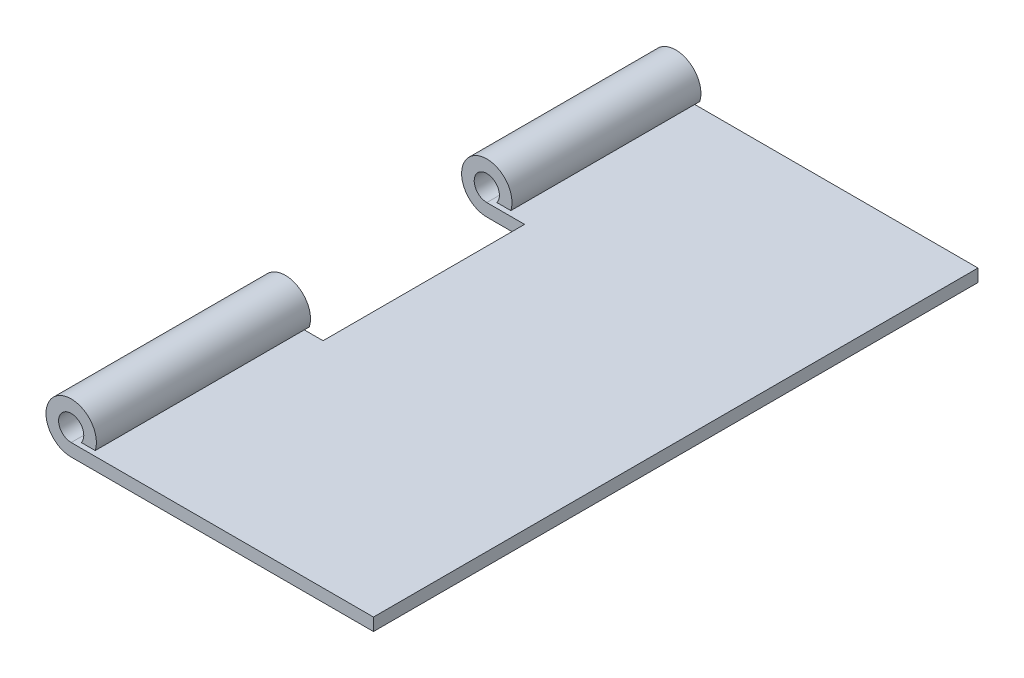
ISO-10303-21;
HEADER;
FILE_DESCRIPTION(('STEP AP214'),'2;1');
FILE_NAME('part.step','',(''),(''),'','','');
FILE_SCHEMA(('AUTOMOTIVE_DESIGN { 1 0 10303 214 1 1 1 1 }'));
ENDSEC;
DATA;
#1=APPLICATION_CONTEXT('core data for automotive mechanical design processes');
#2=APPLICATION_PROTOCOL_DEFINITION('international standard','automotive_design',2000,#1);
#3=PRODUCT_CONTEXT('',#1,'mechanical');
#4=PRODUCT('Part','Part','',(#3));
#5=PRODUCT_RELATED_PRODUCT_CATEGORY('part','',(#4));
#6=PRODUCT_DEFINITION_FORMATION('','',#4);
#7=PRODUCT_DEFINITION_CONTEXT('part definition',#1,'design');
#8=PRODUCT_DEFINITION('design','',#6,#7);
#9=PRODUCT_DEFINITION_SHAPE('','',#8);
#10=(LENGTH_UNIT() NAMED_UNIT(*) SI_UNIT(.MILLI.,.METRE.));
#11=(NAMED_UNIT(*) PLANE_ANGLE_UNIT() SI_UNIT($,.RADIAN.));
#12=(NAMED_UNIT(*) SI_UNIT($,.STERADIAN.) SOLID_ANGLE_UNIT());
#13=UNCERTAINTY_MEASURE_WITH_UNIT(LENGTH_MEASURE(1.E-05),#10,'distance_accuracy_value','');
#14=(GEOMETRIC_REPRESENTATION_CONTEXT(3) GLOBAL_UNCERTAINTY_ASSIGNED_CONTEXT((#13)) GLOBAL_UNIT_ASSIGNED_CONTEXT((#10,
#11,#12)) REPRESENTATION_CONTEXT('',''));
#15=CARTESIAN_POINT('',(0.,0.,0.));
#16=DIRECTION('',(0.,0.,1.));
#17=DIRECTION('',(1.,0.,0.));
#18=AXIS2_PLACEMENT_3D('',#15,#16,#17);
#19=CARTESIAN_POINT('',(39.59012726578,8.80634716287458,60.));
#20=DIRECTION('',(0.,0.,-1.));
#21=DIRECTION('',(-1.,0.,0.));
#22=AXIS2_PLACEMENT_3D('',#19,#20,#21);
#23=CYLINDRICAL_SURFACE('',#22,2.5);
#24=DIRECTION('',(0.,0.,-1.));
#25=VECTOR('',#24,1.);
#26=CARTESIAN_POINT('',(39.59012726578,6.30634716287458,60.));
#27=LINE('',#26,#25);
#28=CARTESIAN_POINT('',(39.59012726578,6.30634716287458,60.));
#29=VERTEX_POINT('',#28);
#30=CARTESIAN_POINT('',(39.59012726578,6.30634716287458,39.8734177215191));
#31=VERTEX_POINT('',#30);
#32=EDGE_CURVE('E213',#29,#31,#27,.T.);
#33=ORIENTED_EDGE('',*,*,#32,.T.);
#34=CARTESIAN_POINT('',(39.59012726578,8.80634716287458,39.8734177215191));
#35=DIRECTION('',(0.,0.,-1.));
#36=DIRECTION('',(-1.,0.,0.));
#37=AXIS2_PLACEMENT_3D('',#34,#35,#36);
#38=CIRCLE('',#37,2.5);
#39=CARTESIAN_POINT('',(41.59012726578,7.30634716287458,39.8734177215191));
#40=VERTEX_POINT('',#39);
#41=EDGE_CURVE('E11',#31,#40,#38,.T.);
#42=ORIENTED_EDGE('',*,*,#41,.T.);
#43=DIRECTION('',(0.,0.,-1.));
#44=VECTOR('',#43,1.);
#45=CARTESIAN_POINT('',(41.59012726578,7.30634716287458,60.));
#46=LINE('',#45,#44);
#47=CARTESIAN_POINT('',(41.59012726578,7.30634716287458,60.));
#48=VERTEX_POINT('',#47);
#49=EDGE_CURVE('E207',#48,#40,#46,.T.);
#50=ORIENTED_EDGE('',*,*,#49,.F.);
#51=CARTESIAN_POINT('',(39.59012726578,8.80634716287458,60.));
#52=DIRECTION('',(0.,0.,1.));
#53=DIRECTION('',(1.,0.,0.));
#54=AXIS2_PLACEMENT_3D('',#51,#52,#53);
#55=CIRCLE('',#54,2.5);
#56=EDGE_CURVE('E197',#48,#29,#55,.T.);
#57=ORIENTED_EDGE('',*,*,#56,.T.);
#58=EDGE_LOOP('',(#33,#42,#50,#57));
#59=FACE_BOUND('',#58,.T.);
#60=ADVANCED_FACE('F38',(#59),#23,.F.);
#61=CARTESIAN_POINT('',(39.59012726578,6.30634716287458,-22.5));
#62=VERTEX_POINT('',#61);
#63=CARTESIAN_POINT('',(39.59012726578,6.30634716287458,-40.0843881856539));
#64=VERTEX_POINT('',#63);
#65=EDGE_CURVE('E217',#62,#64,#27,.T.);
#66=ORIENTED_EDGE('',*,*,#65,.T.);
#67=CARTESIAN_POINT('',(39.59012726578,8.80634716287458,-40.0843881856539));
#68=DIRECTION('',(0.,0.,-1.));
#69=DIRECTION('',(-1.,0.,0.));
#70=AXIS2_PLACEMENT_3D('',#67,#68,#69);
#71=CIRCLE('',#70,2.5);
#72=CARTESIAN_POINT('',(41.59012726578,7.30634716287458,-40.0843881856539));
#73=VERTEX_POINT('',#72);
#74=EDGE_CURVE('E47',#64,#73,#71,.T.);
#75=ORIENTED_EDGE('',*,*,#74,.T.);
#76=CARTESIAN_POINT('',(41.59012726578,7.30634716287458,-22.5));
#77=VERTEX_POINT('',#76);
#78=EDGE_CURVE('E212',#77,#73,#46,.T.);
#79=ORIENTED_EDGE('',*,*,#78,.F.);
#80=CARTESIAN_POINT('',(39.59012726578,8.80634716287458,-22.5));
#81=DIRECTION('',(0.,0.,-1.));
#82=DIRECTION('',(-1.,0.,0.));
#83=AXIS2_PLACEMENT_3D('',#80,#81,#82);
#84=CIRCLE('',#83,2.5);
#85=EDGE_CURVE('E260',#62,#77,#84,.T.);
#86=ORIENTED_EDGE('',*,*,#85,.F.);
#87=EDGE_LOOP('',(#66,#75,#79,#86));
#88=FACE_BOUND('',#87,.T.);
#89=ADVANCED_FACE('F233',(#88),#23,.F.);
#90=CARTESIAN_POINT('',(39.59012726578,8.80634716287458,60.));
#91=DIRECTION('',(0.,0.,-1.));
#92=DIRECTION('',(-1.,0.,0.));
#93=AXIS2_PLACEMENT_3D('',#90,#91,#92);
#94=CYLINDRICAL_SURFACE('',#93,5.);
#95=DIRECTION('',(0.,0.,-1.));
#96=VECTOR('',#95,1.);
#97=CARTESIAN_POINT('',(44.3598232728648,7.30634716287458,60.));
#98=LINE('',#97,#96);
#99=CARTESIAN_POINT('',(44.3598232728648,7.30634716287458,60.));
#100=VERTEX_POINT('',#99);
#101=CARTESIAN_POINT('',(44.3598232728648,7.30634716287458,17.4999999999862));
#102=VERTEX_POINT('',#101);
#103=EDGE_CURVE('E204',#100,#102,#98,.T.);
#104=ORIENTED_EDGE('',*,*,#103,.T.);
#105=CARTESIAN_POINT('',(39.59012726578,8.80634716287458,17.4999999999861));
#106=DIRECTION('',(0.,0.,-1.));
#107=DIRECTION('',(0.,1.,0.));
#108=AXIS2_PLACEMENT_3D('',#105,#106,#107);
#109=CIRCLE('',#108,5.00000000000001);
#110=CARTESIAN_POINT('',(39.59012726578,3.80634716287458,17.4999999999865));
#111=VERTEX_POINT('',#110);
#112=EDGE_CURVE('E146',#111,#102,#109,.T.);
#113=ORIENTED_EDGE('',*,*,#112,.F.);
#114=DIRECTION('',(0.,0.,-1.));
#115=VECTOR('',#114,1.);
#116=CARTESIAN_POINT('',(39.59012726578,3.80634716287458,60.));
#117=LINE('',#116,#115);
#118=CARTESIAN_POINT('',(39.59012726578,3.80634716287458,60.));
#119=VERTEX_POINT('',#118);
#120=EDGE_CURVE('E142',#119,#111,#117,.T.);
#121=ORIENTED_EDGE('',*,*,#120,.F.);
#122=CARTESIAN_POINT('',(39.59012726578,8.80634716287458,60.));
#123=DIRECTION('',(0.,0.,1.));
#124=DIRECTION('',(1.,0.,0.));
#125=AXIS2_PLACEMENT_3D('',#122,#123,#124);
#126=CIRCLE('',#125,5.);
#127=EDGE_CURVE('E185',#100,#119,#126,.T.);
#128=ORIENTED_EDGE('',*,*,#127,.F.);
#129=EDGE_LOOP('',(#104,#113,#121,#128));
#130=FACE_BOUND('',#129,.T.);
#131=ADVANCED_FACE('F288',(#130),#94,.T.);
#132=ORIENTED_EDGE('',*,*,#41,.F.);
#133=CARTESIAN_POINT('',(39.59012726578,6.30634716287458,17.4999999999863));
#134=VERTEX_POINT('',#133);
#135=EDGE_CURVE('E216',#31,#134,#27,.T.);
#136=ORIENTED_EDGE('',*,*,#135,.T.);
#137=CARTESIAN_POINT('',(39.59012726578,8.80634716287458,17.4999999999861));
#138=DIRECTION('',(0.,0.,-1.));
#139=DIRECTION('',(0.,1.,0.));
#140=AXIS2_PLACEMENT_3D('',#137,#138,#139);
#141=CIRCLE('',#140,2.5);
#142=CARTESIAN_POINT('',(41.59012726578,7.30634716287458,17.4999999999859));
#143=VERTEX_POINT('',#142);
#144=EDGE_CURVE('E252',#143,#134,#141,.F.);
#145=ORIENTED_EDGE('',*,*,#144,.F.);
#146=EDGE_CURVE('E211',#40,#143,#46,.T.);
#147=ORIENTED_EDGE('',*,*,#146,.F.);
#148=EDGE_LOOP('',(#132,#136,#145,#147));
#149=FACE_BOUND('',#148,.T.);
#150=ADVANCED_FACE('F253',(#149),#23,.F.);
#151=CARTESIAN_POINT('',(44.3598232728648,7.30634716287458,60.));
#152=DIRECTION('',(0.,-1.,0.));
#153=DIRECTION('',(1.,0.,0.));
#154=AXIS2_PLACEMENT_3D('',#151,#152,#153);
#155=PLANE('',#154);
#156=ORIENTED_EDGE('',*,*,#146,.T.);
#157=DIRECTION('',(-1.,0.,0.));
#158=VECTOR('',#157,1.);
#159=CARTESIAN_POINT('',(44.3598232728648,7.30634716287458,17.4999999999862));
#160=LINE('',#159,#158);
#161=EDGE_CURVE('E251',#102,#143,#160,.T.);
#162=ORIENTED_EDGE('',*,*,#161,.F.);
#163=ORIENTED_EDGE('',*,*,#103,.F.);
#164=DIRECTION('',(-1.,0.,0.));
#165=VECTOR('',#164,1.);
#166=CARTESIAN_POINT('',(44.3598232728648,7.30634716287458,60.));
#167=LINE('',#166,#165);
#168=EDGE_CURVE('E200',#100,#48,#167,.T.);
#169=ORIENTED_EDGE('',*,*,#168,.T.);
#170=ORIENTED_EDGE('',*,*,#49,.T.);
#171=EDGE_LOOP('',(#156,#162,#163,#169,#170));
#172=FACE_BOUND('',#171,.T.);
#173=ADVANCED_FACE('F249',(#172),#155,.T.);
#174=CARTESIAN_POINT('',(39.59012726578,3.80634716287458,-22.5));
#175=VERTEX_POINT('',#174);
#176=CARTESIAN_POINT('',(39.59012726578,3.80634716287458,-60.));
#177=VERTEX_POINT('',#176);
#178=EDGE_CURVE('E221',#175,#177,#117,.T.);
#179=ORIENTED_EDGE('',*,*,#178,.F.);
#180=CARTESIAN_POINT('',(39.59012726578,8.80634716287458,-22.5));
#181=DIRECTION('',(0.,0.,-1.));
#182=DIRECTION('',(-1.,0.,0.));
#183=AXIS2_PLACEMENT_3D('',#180,#181,#182);
#184=CIRCLE('',#183,5.);
#185=CARTESIAN_POINT('',(44.3598232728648,7.30634716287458,-22.5));
#186=VERTEX_POINT('',#185);
#187=EDGE_CURVE('E167',#175,#186,#184,.T.);
#188=ORIENTED_EDGE('',*,*,#187,.T.);
#189=CARTESIAN_POINT('',(44.3598232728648,7.30634716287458,-60.));
#190=VERTEX_POINT('',#189);
#191=EDGE_CURVE('E203',#186,#190,#98,.T.);
#192=ORIENTED_EDGE('',*,*,#191,.T.);
#193=CARTESIAN_POINT('',(39.59012726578,8.80634716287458,-60.));
#194=DIRECTION('',(0.,0.,1.));
#195=DIRECTION('',(1.,0.,0.));
#196=AXIS2_PLACEMENT_3D('',#193,#194,#195);
#197=CIRCLE('',#196,5.);
#198=EDGE_CURVE('E161',#190,#177,#197,.T.);
#199=ORIENTED_EDGE('',*,*,#198,.T.);
#200=EDGE_LOOP('',(#179,#188,#192,#199));
#201=FACE_BOUND('',#200,.T.);
#202=ADVANCED_FACE('F266',(#201),#94,.T.);
#203=CARTESIAN_POINT('',(39.59012726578,3.80634716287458,60.));
#204=DIRECTION('',(0.,1.,0.));
#205=DIRECTION('',(0.,0.,1.));
#206=AXIS2_PLACEMENT_3D('',#203,#204,#205);
#207=PLANE('',#206);
#208=ORIENTED_EDGE('',*,*,#120,.T.);
#209=DIRECTION('',(-1.,0.,0.));
#210=VECTOR('',#209,1.);
#211=CARTESIAN_POINT('',(39.59012726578,3.80634716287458,17.4999999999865));
#212=LINE('',#211,#210);
#213=CARTESIAN_POINT('',(47.09012726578,3.80634716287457,17.4999999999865));
#214=VERTEX_POINT('',#213);
#215=EDGE_CURVE('E136',#214,#111,#212,.T.);
#216=ORIENTED_EDGE('',*,*,#215,.F.);
#217=DIRECTION('',(0.,0.,1.));
#218=VECTOR('',#217,1.);
#219=CARTESIAN_POINT('',(47.09012726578,3.80634716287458,60.));
#220=LINE('',#219,#218);
#221=CARTESIAN_POINT('',(47.09012726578,3.80634716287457,-22.5));
#222=VERTEX_POINT('',#221);
#223=EDGE_CURVE('E140',#222,#214,#220,.T.);
#224=ORIENTED_EDGE('',*,*,#223,.F.);
#225=DIRECTION('',(-1.,0.,0.));
#226=VECTOR('',#225,1.);
#227=CARTESIAN_POINT('',(39.59012726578,3.80634716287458,-22.5));
#228=LINE('',#227,#226);
#229=EDGE_CURVE('E162',#222,#175,#228,.T.);
#230=ORIENTED_EDGE('',*,*,#229,.T.);
#231=ORIENTED_EDGE('',*,*,#178,.T.);
#232=DIRECTION('',(1.,0.,0.));
#233=VECTOR('',#232,1.);
#234=CARTESIAN_POINT('',(39.59012726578,3.80634716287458,-60.));
#235=LINE('',#234,#233);
#236=CARTESIAN_POINT('',(99.59012726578,3.80634716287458,-60.));
#237=VERTEX_POINT('',#236);
#238=EDGE_CURVE('E165',#177,#237,#235,.T.);
#239=ORIENTED_EDGE('',*,*,#238,.T.);
#240=DIRECTION('',(0.,0.,-1.));
#241=VECTOR('',#240,1.);
#242=CARTESIAN_POINT('',(99.59012726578,3.80634716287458,60.));
#243=LINE('',#242,#241);
#244=CARTESIAN_POINT('',(99.59012726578,3.80634716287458,60.));
#245=VERTEX_POINT('',#244);
#246=EDGE_CURVE('E219',#245,#237,#243,.T.);
#247=ORIENTED_EDGE('',*,*,#246,.F.);
#248=DIRECTION('',(1.,0.,0.));
#249=VECTOR('',#248,1.);
#250=CARTESIAN_POINT('',(39.59012726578,3.80634716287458,60.));
#251=LINE('',#250,#249);
#252=EDGE_CURVE('E188',#119,#245,#251,.T.);
#253=ORIENTED_EDGE('',*,*,#252,.F.);
#254=EDGE_LOOP('',(#208,#216,#224,#230,#231,#239,#247,#253));
#255=FACE_BOUND('',#254,.T.);
#256=ADVANCED_FACE('F40',(#255),#207,.F.);
#257=CARTESIAN_POINT('',(99.59012726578,3.80634716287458,60.));
#258=DIRECTION('',(-1.,0.,0.));
#259=DIRECTION('',(0.,0.,1.));
#260=AXIS2_PLACEMENT_3D('',#257,#258,#259);
#261=PLANE('',#260);
#262=DIRECTION('',(0.,0.,-1.));
#263=VECTOR('',#262,1.);
#264=CARTESIAN_POINT('',(99.59012726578,6.30634716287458,60.));
#265=LINE('',#264,#263);
#266=CARTESIAN_POINT('',(99.59012726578,6.30634716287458,60.));
#267=VERTEX_POINT('',#266);
#268=CARTESIAN_POINT('',(99.59012726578,6.30634716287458,-60.));
#269=VERTEX_POINT('',#268);
#270=EDGE_CURVE('E215',#267,#269,#265,.T.);
#271=ORIENTED_EDGE('',*,*,#270,.F.);
#272=DIRECTION('',(0.,1.,0.));
#273=VECTOR('',#272,1.);
#274=CARTESIAN_POINT('',(99.59012726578,3.80634716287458,60.));
#275=LINE('',#274,#273);
#276=EDGE_CURVE('E191',#245,#267,#275,.T.);
#277=ORIENTED_EDGE('',*,*,#276,.F.);
#278=ORIENTED_EDGE('',*,*,#246,.T.);
#279=DIRECTION('',(0.,1.,0.));
#280=VECTOR('',#279,1.);
#281=CARTESIAN_POINT('',(99.59012726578,3.80634716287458,-60.));
#282=LINE('',#281,#280);
#283=EDGE_CURVE('E173',#237,#269,#282,.T.);
#284=ORIENTED_EDGE('',*,*,#283,.T.);
#285=EDGE_LOOP('',(#271,#277,#278,#284));
#286=FACE_BOUND('',#285,.T.);
#287=ADVANCED_FACE('F281',(#286),#261,.F.);
#288=CARTESIAN_POINT('',(39.59012726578,6.30634716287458,60.));
#289=DIRECTION('',(0.,1.,0.));
#290=DIRECTION('',(0.,0.,1.));
#291=AXIS2_PLACEMENT_3D('',#288,#289,#290);
#292=PLANE('',#291);
#293=DIRECTION('',(0.,0.,1.));
#294=VECTOR('',#293,1.);
#295=CARTESIAN_POINT('',(47.09012726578,6.30634716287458,60.));
#296=LINE('',#295,#294);
#297=CARTESIAN_POINT('',(47.09012726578,6.30634716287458,-22.5));
#298=VERTEX_POINT('',#297);
#299=CARTESIAN_POINT('',(47.09012726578,6.30634716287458,17.4999999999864));
#300=VERTEX_POINT('',#299);
#301=EDGE_CURVE('E225',#298,#300,#296,.T.);
#302=ORIENTED_EDGE('',*,*,#301,.T.);
#303=DIRECTION('',(1.,0.,0.));
#304=VECTOR('',#303,1.);
#305=CARTESIAN_POINT('',(39.59012726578,6.30634716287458,17.4999999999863));
#306=LINE('',#305,#304);
#307=EDGE_CURVE('E153',#134,#300,#306,.T.);
#308=ORIENTED_EDGE('',*,*,#307,.F.);
#309=ORIENTED_EDGE('',*,*,#135,.F.);
#310=ORIENTED_EDGE('',*,*,#32,.F.);
#311=DIRECTION('',(1.,0.,0.));
#312=VECTOR('',#311,1.);
#313=CARTESIAN_POINT('',(39.59012726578,6.30634716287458,60.));
#314=LINE('',#313,#312);
#315=EDGE_CURVE('E194',#29,#267,#314,.T.);
#316=ORIENTED_EDGE('',*,*,#315,.T.);
#317=ORIENTED_EDGE('',*,*,#270,.T.);
#318=DIRECTION('',(1.,0.,0.));
#319=VECTOR('',#318,1.);
#320=CARTESIAN_POINT('',(39.59012726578,6.30634716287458,-60.));
#321=LINE('',#320,#319);
#322=CARTESIAN_POINT('',(39.59012726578,6.30634716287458,-60.));
#323=VERTEX_POINT('',#322);
#324=EDGE_CURVE('E176',#323,#269,#321,.T.);
#325=ORIENTED_EDGE('',*,*,#324,.F.);
#326=EDGE_CURVE('E210',#64,#323,#27,.T.);
#327=ORIENTED_EDGE('',*,*,#326,.F.);
#328=ORIENTED_EDGE('',*,*,#65,.F.);
#329=DIRECTION('',(-1.,0.,0.));
#330=VECTOR('',#329,1.);
#331=CARTESIAN_POINT('',(39.59012726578,6.30634716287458,-22.5));
#332=LINE('',#331,#330);
#333=EDGE_CURVE('E262',#298,#62,#332,.T.);
#334=ORIENTED_EDGE('',*,*,#333,.F.);
#335=EDGE_LOOP('',(#302,#308,#309,#310,#316,#317,#325,#327,#328,#334));
#336=FACE_BOUND('',#335,.T.);
#337=ADVANCED_FACE('F276',(#336),#292,.T.);
#338=ORIENTED_EDGE('',*,*,#74,.F.);
#339=ORIENTED_EDGE('',*,*,#326,.T.);
#340=CARTESIAN_POINT('',(39.59012726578,8.80634716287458,-60.));
#341=DIRECTION('',(0.,0.,1.));
#342=DIRECTION('',(1.,0.,0.));
#343=AXIS2_PLACEMENT_3D('',#340,#341,#342);
#344=CIRCLE('',#343,2.5);
#345=CARTESIAN_POINT('',(41.59012726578,7.30634716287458,-60.));
#346=VERTEX_POINT('',#345);
#347=EDGE_CURVE('E179',#346,#323,#344,.T.);
#348=ORIENTED_EDGE('',*,*,#347,.F.);
#349=EDGE_CURVE('E206',#73,#346,#46,.T.);
#350=ORIENTED_EDGE('',*,*,#349,.F.);
#351=EDGE_LOOP('',(#338,#339,#348,#350));
#352=FACE_BOUND('',#351,.T.);
#353=ADVANCED_FACE('F240',(#352),#23,.F.);
#354=DIRECTION('',(1.,0.,0.));
#355=VECTOR('',#354,1.);
#356=CARTESIAN_POINT('',(44.3598232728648,7.30634716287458,-22.5));
#357=LINE('',#356,#355);
#358=EDGE_CURVE('E223',#77,#186,#357,.T.);
#359=ORIENTED_EDGE('',*,*,#358,.F.);
#360=ORIENTED_EDGE('',*,*,#78,.T.);
#361=ORIENTED_EDGE('',*,*,#349,.T.);
#362=DIRECTION('',(-1.,0.,0.));
#363=VECTOR('',#362,1.);
#364=CARTESIAN_POINT('',(44.3598232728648,7.30634716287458,-60.));
#365=LINE('',#364,#363);
#366=EDGE_CURVE('E182',#190,#346,#365,.T.);
#367=ORIENTED_EDGE('',*,*,#366,.F.);
#368=ORIENTED_EDGE('',*,*,#191,.F.);
#369=EDGE_LOOP('',(#359,#360,#361,#367,#368));
#370=FACE_BOUND('',#369,.T.);
#371=ADVANCED_FACE('F244',(#370),#155,.T.);
#372=CARTESIAN_POINT('',(39.59012726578,8.80634716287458,60.));
#373=DIRECTION('',(0.,0.,1.));
#374=DIRECTION('',(1.,0.,0.));
#375=AXIS2_PLACEMENT_3D('',#372,#373,#374);
#376=PLANE('',#375);
#377=ORIENTED_EDGE('',*,*,#127,.T.);
#378=ORIENTED_EDGE('',*,*,#252,.T.);
#379=ORIENTED_EDGE('',*,*,#276,.T.);
#380=ORIENTED_EDGE('',*,*,#315,.F.);
#381=ORIENTED_EDGE('',*,*,#56,.F.);
#382=ORIENTED_EDGE('',*,*,#168,.F.);
#383=EDGE_LOOP('',(#377,#378,#379,#380,#381,#382));
#384=FACE_BOUND('',#383,.T.);
#385=ADVANCED_FACE('F283',(#384),#376,.T.);
#386=CARTESIAN_POINT('',(39.59012726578,8.80634716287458,-60.));
#387=DIRECTION('',(0.,0.,1.));
#388=DIRECTION('',(1.,0.,0.));
#389=AXIS2_PLACEMENT_3D('',#386,#387,#388);
#390=PLANE('',#389);
#391=ORIENTED_EDGE('',*,*,#198,.F.);
#392=ORIENTED_EDGE('',*,*,#366,.T.);
#393=ORIENTED_EDGE('',*,*,#347,.T.);
#394=ORIENTED_EDGE('',*,*,#324,.T.);
#395=ORIENTED_EDGE('',*,*,#283,.F.);
#396=ORIENTED_EDGE('',*,*,#238,.F.);
#397=EDGE_LOOP('',(#391,#392,#393,#394,#395,#396));
#398=FACE_BOUND('',#397,.T.);
#399=ADVANCED_FACE('F270',(#398),#390,.F.);
#400=CARTESIAN_POINT('',(47.09012726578,40.,22.5));
#401=DIRECTION('',(-1.,0.,0.));
#402=DIRECTION('',(0.,0.,1.));
#403=AXIS2_PLACEMENT_3D('',#400,#401,#402);
#404=PLANE('',#403);
#405=DIRECTION('',(0.,-1.,0.));
#406=VECTOR('',#405,1.);
#407=CARTESIAN_POINT('',(47.09012726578,6.30634716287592,17.4999999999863));
#408=LINE('',#407,#406);
#409=EDGE_CURVE('E149',#300,#214,#408,.T.);
#410=ORIENTED_EDGE('',*,*,#409,.F.);
#411=ORIENTED_EDGE('',*,*,#301,.F.);
#412=DIRECTION('',(0.,-1.,0.));
#413=VECTOR('',#412,1.);
#414=CARTESIAN_POINT('',(47.09012726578,40.,-22.5));
#415=LINE('',#414,#413);
#416=EDGE_CURVE('E156',#298,#222,#415,.T.);
#417=ORIENTED_EDGE('',*,*,#416,.T.);
#418=ORIENTED_EDGE('',*,*,#223,.T.);
#419=EDGE_LOOP('',(#410,#411,#417,#418));
#420=FACE_BOUND('',#419,.T.);
#421=ADVANCED_FACE('F159',(#420),#404,.T.);
#422=CARTESIAN_POINT('',(-2.90987273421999,40.,-22.5));
#423=DIRECTION('',(0.,0.,-1.));
#424=DIRECTION('',(-1.,0.,0.));
#425=AXIS2_PLACEMENT_3D('',#422,#423,#424);
#426=PLANE('',#425);
#427=ORIENTED_EDGE('',*,*,#416,.F.);
#428=ORIENTED_EDGE('',*,*,#333,.T.);
#429=ORIENTED_EDGE('',*,*,#85,.T.);
#430=ORIENTED_EDGE('',*,*,#358,.T.);
#431=ORIENTED_EDGE('',*,*,#187,.F.);
#432=ORIENTED_EDGE('',*,*,#229,.F.);
#433=EDGE_LOOP('',(#427,#428,#429,#430,#431,#432));
#434=FACE_BOUND('',#433,.T.);
#435=ADVANCED_FACE('F273',(#434),#426,.F.);
#436=CARTESIAN_POINT('',(71.1932918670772,14.3321018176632,17.4999999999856));
#437=DIRECTION('',(0.,0.,-1.));
#438=DIRECTION('',(0.0628151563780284,0.998025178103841,0.));
#439=AXIS2_PLACEMENT_3D('',#436,#437,#438);
#440=PLANE('',#439);
#441=ORIENTED_EDGE('',*,*,#215,.T.);
#442=ORIENTED_EDGE('',*,*,#112,.T.);
#443=ORIENTED_EDGE('',*,*,#161,.T.);
#444=ORIENTED_EDGE('',*,*,#144,.T.);
#445=ORIENTED_EDGE('',*,*,#307,.T.);
#446=ORIENTED_EDGE('',*,*,#409,.T.);
#447=EDGE_LOOP('',(#441,#442,#443,#444,#445,#446));
#448=FACE_BOUND('',#447,.T.);
#449=ADVANCED_FACE('F150',(#448),#440,.T.);
#450=CLOSED_SHELL('',(#60,#89,#131,#150,#173,#202,#256,#287,#337,#353,#371,#385,#399,#421,#435,#449));
#451=MANIFOLD_SOLID_BREP('B2',#450);
#452=ADVANCED_BREP_SHAPE_REPRESENTATION('',(#18,#451),#14);
#453=SHAPE_DEFINITION_REPRESENTATION(#9,#452);
ENDSEC;
END-ISO-10303-21;
